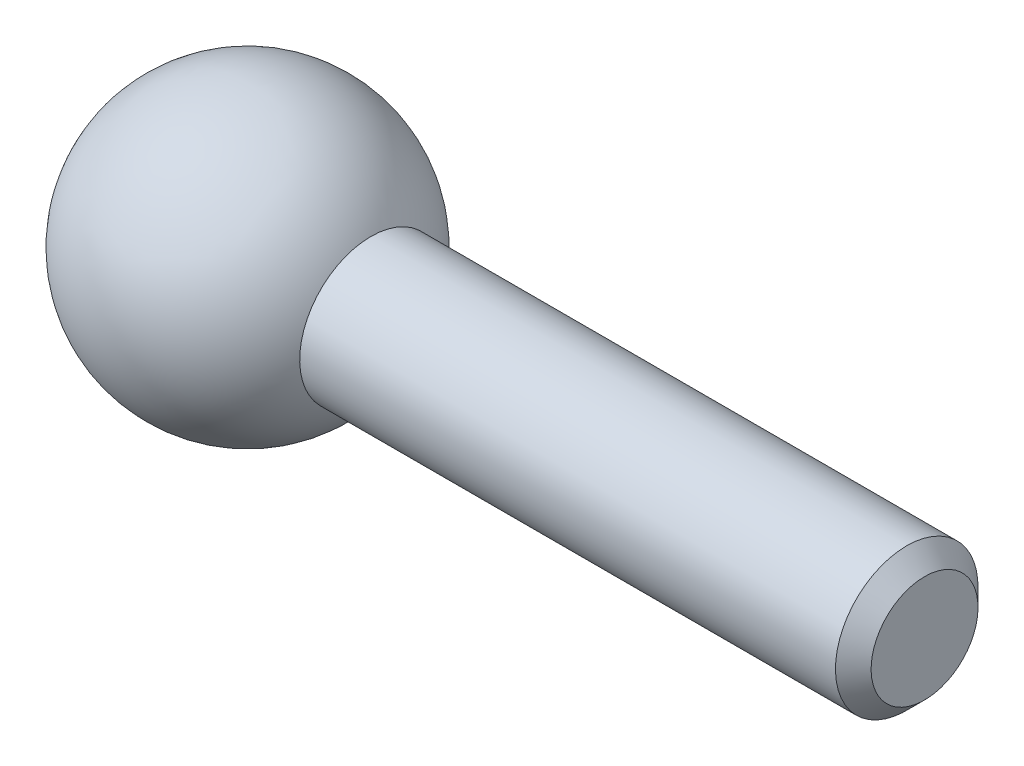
ISO-10303-21;
HEADER;
FILE_DESCRIPTION(('STEP AP214'),'2;1');
FILE_NAME('part.step','',(''),(''),'','','');
FILE_SCHEMA(('AUTOMOTIVE_DESIGN { 1 0 10303 214 1 1 1 1 }'));
ENDSEC;
DATA;
#1=APPLICATION_CONTEXT('core data for automotive mechanical design processes');
#2=APPLICATION_PROTOCOL_DEFINITION('international standard','automotive_design',2000,#1);
#3=PRODUCT_CONTEXT('',#1,'mechanical');
#4=PRODUCT('Part','Part','',(#3));
#5=PRODUCT_RELATED_PRODUCT_CATEGORY('part','',(#4));
#6=PRODUCT_DEFINITION_FORMATION('','',#4);
#7=PRODUCT_DEFINITION_CONTEXT('part definition',#1,'design');
#8=PRODUCT_DEFINITION('design','',#6,#7);
#9=PRODUCT_DEFINITION_SHAPE('','',#8);
#10=(LENGTH_UNIT() NAMED_UNIT(*) SI_UNIT(.MILLI.,.METRE.));
#11=(NAMED_UNIT(*) PLANE_ANGLE_UNIT() SI_UNIT($,.RADIAN.));
#12=(NAMED_UNIT(*) SI_UNIT($,.STERADIAN.) SOLID_ANGLE_UNIT());
#13=UNCERTAINTY_MEASURE_WITH_UNIT(LENGTH_MEASURE(1.E-05),#10,'distance_accuracy_value','');
#14=(GEOMETRIC_REPRESENTATION_CONTEXT(3) GLOBAL_UNCERTAINTY_ASSIGNED_CONTEXT((#13)) GLOBAL_UNIT_ASSIGNED_CONTEXT((#10,
#11,#12)) REPRESENTATION_CONTEXT('',''));
#15=CARTESIAN_POINT('',(0.,0.,0.));
#16=DIRECTION('',(0.,0.,1.));
#17=DIRECTION('',(1.,0.,0.));
#18=AXIS2_PLACEMENT_3D('',#15,#16,#17);
#19=CARTESIAN_POINT('',(19.,0.,0.));
#20=DIRECTION('',(1.,0.,0.));
#21=DIRECTION('',(0.,1.,0.));
#22=AXIS2_PLACEMENT_3D('',#19,#20,#21);
#23=PLANE('',#22);
#24=CARTESIAN_POINT('',(19.,0.,0.));
#25=DIRECTION('',(1.,0.,0.));
#26=DIRECTION('',(0.,1.,0.));
#27=AXIS2_PLACEMENT_3D('',#24,#25,#26);
#28=CIRCLE('',#27,1.5);
#29=CARTESIAN_POINT('',(19.,1.5,0.));
#30=VERTEX_POINT('',#29);
#31=EDGE_CURVE('E354',#30,#30,#28,.T.);
#32=ORIENTED_EDGE('',*,*,#31,.T.);
#33=EDGE_LOOP('',(#32));
#34=FACE_BOUND('',#33,.T.);
#35=ADVANCED_FACE('F348',(#34),#23,.T.);
#36=CARTESIAN_POINT('',(0.,0.,0.));
#37=DIRECTION('',(1.,0.,0.));
#38=DIRECTION('',(0.,1.,0.));
#39=AXIS2_PLACEMENT_3D('',#36,#37,#38);
#40=CYLINDRICAL_SURFACE('',#39,2.);
#41=CARTESIAN_POINT('',(18.5,0.,0.));
#42=DIRECTION('',(1.,0.,0.));
#43=DIRECTION('',(0.,1.,0.));
#44=AXIS2_PLACEMENT_3D('',#41,#42,#43);
#45=CIRCLE('',#44,2.);
#46=CARTESIAN_POINT('',(18.5,2.,0.));
#47=VERTEX_POINT('',#46);
#48=EDGE_CURVE('E10',#47,#47,#45,.F.);
#49=ORIENTED_EDGE('',*,*,#48,.T.);
#50=EDGE_LOOP('',(#49));
#51=FACE_BOUND('',#50,.T.);
#52=CARTESIAN_POINT('',(3.46410161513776,0.,0.));
#53=DIRECTION('',(1.,0.,0.));
#54=DIRECTION('',(0.,1.,0.));
#55=AXIS2_PLACEMENT_3D('',#52,#53,#54);
#56=CIRCLE('',#55,2.);
#57=CARTESIAN_POINT('',(3.46410161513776,2.,0.));
#58=VERTEX_POINT('',#57);
#59=EDGE_CURVE('E358',#58,#58,#56,.T.);
#60=ORIENTED_EDGE('',*,*,#59,.T.);
#61=EDGE_LOOP('',(#60));
#62=FACE_BOUND('',#61,.T.);
#63=ADVANCED_FACE('F365',(#51,#62),#40,.T.);
#64=CARTESIAN_POINT('',(0.,0.,0.));
#65=DIRECTION('',(1.,0.,0.));
#66=DIRECTION('',(0.,1.,0.));
#67=AXIS2_PLACEMENT_3D('',#64,#65,#66);
#68=SPHERICAL_SURFACE('',#67,4.);
#69=ORIENTED_EDGE('',*,*,#59,.F.);
#70=EDGE_LOOP('',(#69));
#71=FACE_BOUND('',#70,.T.);
#72=ADVANCED_FACE('F367',(#71),#68,.T.);
#73=CARTESIAN_POINT('',(19.,0.,0.));
#74=DIRECTION('',(-1.,0.,0.));
#75=DIRECTION('',(0.,-1.,0.));
#76=AXIS2_PLACEMENT_3D('',#73,#74,#75);
#77=CONICAL_SURFACE('',#76,1.5,0.785398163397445);
#78=ORIENTED_EDGE('',*,*,#48,.F.);
#79=EDGE_LOOP('',(#78));
#80=FACE_BOUND('',#79,.T.);
#81=ORIENTED_EDGE('',*,*,#31,.F.);
#82=EDGE_LOOP('',(#81));
#83=FACE_BOUND('',#82,.T.);
#84=ADVANCED_FACE('F369',(#80,#83),#77,.T.);
#85=CLOSED_SHELL('',(#35,#63,#72,#84));
#86=MANIFOLD_SOLID_BREP('B2',#85);
#87=ADVANCED_BREP_SHAPE_REPRESENTATION('',(#18,#86),#14);
#88=SHAPE_DEFINITION_REPRESENTATION(#9,#87);
ENDSEC;
END-ISO-10303-21;
